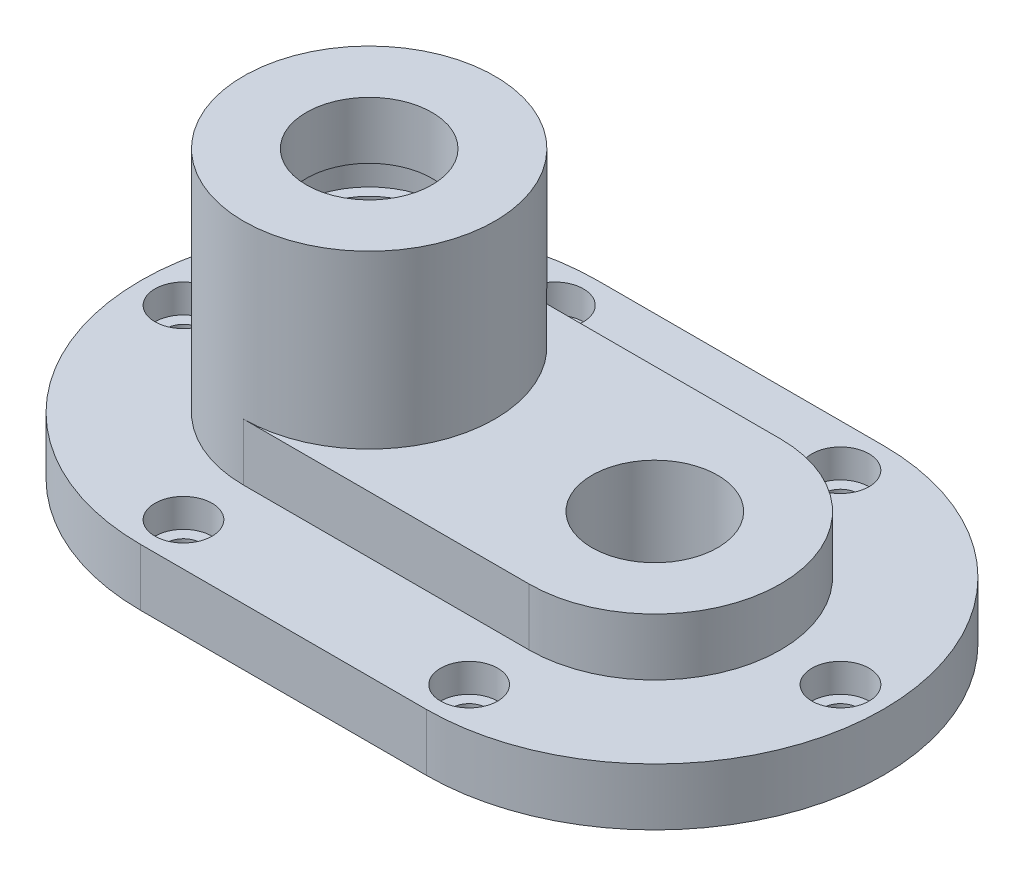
from build123d import *

# Parameters (mm, degrees)
EXTRUDE_1_DEPTH          = 10
SKETCH_2_R               = 5
CUT_EXTRUDE_2_DEPTH      = 5
SKETCH_3_R               = 3
CUT_EXTRUDE_3_DEPTH      = 121.519707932
EXTRUDE_2_DEPTH          = 10
SKETCH_5_R               = 22
EXTRUDE_3_DEPTH          = 30
CUT_EXTRUDE_6_DEPTH      = 125.09673646
CUT_EXTRUDE_6_DEPTH_BACK = 125.09673646
SKETCH_6_R               = 11
CUT_EXTRUDE_START        = 20
SKETCH_6_7_R             = 11
SKETCH_6_7_R_2           = 13
CUT_EXTRUDE_9_DEPTH      = 5


with BuildPart() as part:
    # Sketch 1 → Extrude 1 (new body)
    with BuildSketch(Plane(origin=(0, 0, 0), x_dir=(1, 0, 0), z_dir=(0, 1, 0))):
        with BuildLine():
            Line((0, 0), (50, 0))
            ThreePointArc((50, 0), (90, 40), (50, 80))
            Line((50, 80), (0, 80))
            ThreePointArc((0, 80), (-40, 40), (0, 0))
        make_face()
    extrude(amount=EXTRUDE_1_DEPTH)

    # Sketch 2 → Cut-Extrude 2 (cut)
    with BuildSketch(Plane(origin=(0, 10, 0), x_dir=(1, 0, 0), z_dir=(0, 1, 0))):
        with Locations(Location((0, 7.5, 0), (0, 0, 270))):
            Circle(SKETCH_2_R)
        with Locations(Location((50, 72.5, 0), (0, 0, 270))):
            Circle(SKETCH_2_R)
        with Locations(Location((0, 72.5, 0), (0, 0, 270))):
            Circle(SKETCH_2_R)
        with Locations(Location((50, 7.5, 0), (0, 0, 270))):
            Circle(SKETCH_2_R)
        with Locations(Location((82.5, 40, 0), (0, 0, 270))):
            Circle(SKETCH_2_R)
        with Locations(Location((-32.5, 40, 0), (0, 0, 270))):
            Circle(SKETCH_2_R)
    extrude(amount=-CUT_EXTRUDE_2_DEPTH, mode=Mode.SUBTRACT)

    # Sketch 3 → Cut-Extrude 3 (cut, through all)
    with BuildSketch(Plane(origin=(0, 5, 0), x_dir=(1, 0, 0), z_dir=(0, 1, 0))):
        with Locations(Location((-32.5, 40, 0), (0, 0, 270))):
            Circle(SKETCH_3_R)
        with Locations(Location((0, 72.5, 0), (0, 0, 270))):
            Circle(SKETCH_3_R)
        with Locations(Location((50, 72.5, 0), (0, 0, 270))):
            Circle(SKETCH_3_R)
        with Locations(Location((82.5, 40, 0), (0, 0, 270))):
            Circle(SKETCH_3_R)
        with Locations(Location((50, 7.5, 0), (0, 0, 270))):
            Circle(SKETCH_3_R)
        with Locations(Location((0, 7.5, 0), (0, 0, 270))):
            Circle(SKETCH_3_R)
    extrude(amount=-CUT_EXTRUDE_3_DEPTH, mode=Mode.SUBTRACT)

    # Sketch 4 → Extrude 2 (add)
    with BuildSketch(Plane(origin=(0, 10, 0), x_dir=(1, 0, 0), z_dir=(0, 1, 0))):
        with BuildLine():
            Line((50, 62), (0, 62))
            ThreePointArc((0, 62), (-22, 40), (0, 18))
            Line((0, 18), (50, 18))
            ThreePointArc((50, 18), (72, 40), (50, 62))
        make_face()
    extrude(amount=EXTRUDE_2_DEPTH)

    # Sketch 5 → Extrude 3 (add)
    with BuildSketch(Plane(origin=(0, 20, 0), x_dir=(1, 0, 0), z_dir=(0, 1, 0))):
        with Locations(Location((0, 40, 0), (0, 0, 270))):
            Circle(SKETCH_5_R)
    extrude(amount=EXTRUDE_3_DEPTH)

    # Sketch 6 → Cut-Extrude 6 (cut, two sides: drawn at the far end of the back side and taken through both)
    with BuildSketch(Plane(origin=(0, 20, 0), x_dir=(1, 0, 0), z_dir=(0, 1, 0)).offset(-CUT_EXTRUDE_6_DEPTH_BACK)):
        with Locations(Location((50, 40, 0), (0, 0, 270))):
            Circle(SKETCH_6_R)
        with Locations(Location((0, 40, 0), (0, 0, 270))):
            Circle(SKETCH_6_R)
    extrude(amount=CUT_EXTRUDE_6_DEPTH + CUT_EXTRUDE_6_DEPTH_BACK, mode=Mode.SUBTRACT)

    # Sketch 6_7 → Cut-Extrude 9 (cut)
    # profile 1 of 2: a face of its own
    with BuildSketch(Plane(origin=(0, 20, 0), x_dir=(1, 0, 0), z_dir=(0, 1, 0)).offset(CUT_EXTRUDE_START)):
        with Locations(Location((50, 40, 0), (0, 0, 270))):
            Circle(SKETCH_6_7_R)
    # profile 2 of 2: a face of its own
    with BuildSketch(Plane(origin=(0, 20, 0), x_dir=(1, 0, 0), z_dir=(0, 1, 0)).offset(CUT_EXTRUDE_START)):
        with Locations(Location((0, 40, 0), (0, 0, 270))):
            Circle(SKETCH_6_7_R_2)
        with Locations(Location((0, 40, 0), (0, 0, 270))):
            Circle(SKETCH_6_7_R, mode=Mode.SUBTRACT)
    extrude(amount=-CUT_EXTRUDE_9_DEPTH, mode=Mode.SUBTRACT)


solid = part.part
